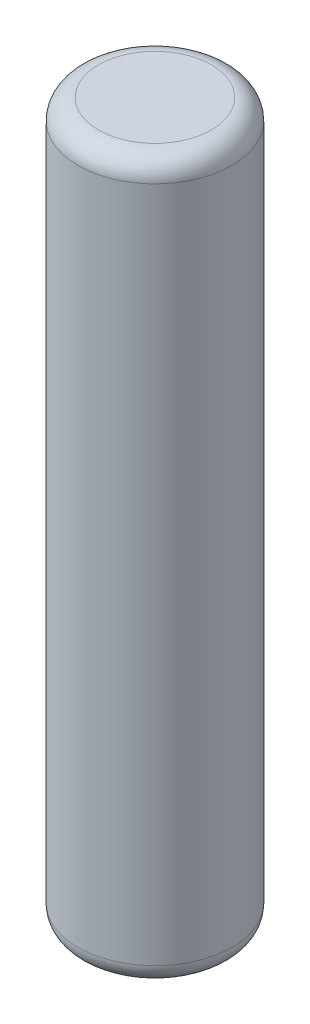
from build123d import *

# Parameters (mm, degrees)
SKETCH_1_R      = 0.375
EXTRUDE_1_DEPTH = 3.5
FILLET_1_R      = 0.1


with BuildPart() as part:
    # Sketch 1 → Extrude 1 (new body)
    with BuildSketch(Plane(origin=(0, 0, 0), x_dir=(1, 0, 0), z_dir=(0, 1, 0))):
        with Locations(Location((0, 0, 0), (0, 0, 270))):
            Circle(SKETCH_1_R)
    extrude(amount=EXTRUDE_1_DEPTH)

    # Fillet 1
    fillet_1_edges = [part.edges().sort_by_distance(p)[0] for p in [
        (0, 0, -0.375),
        (0, 3.5, -0.375),
    ]]
    fillet(fillet_1_edges, radius=FILLET_1_R)


solid = part.part
